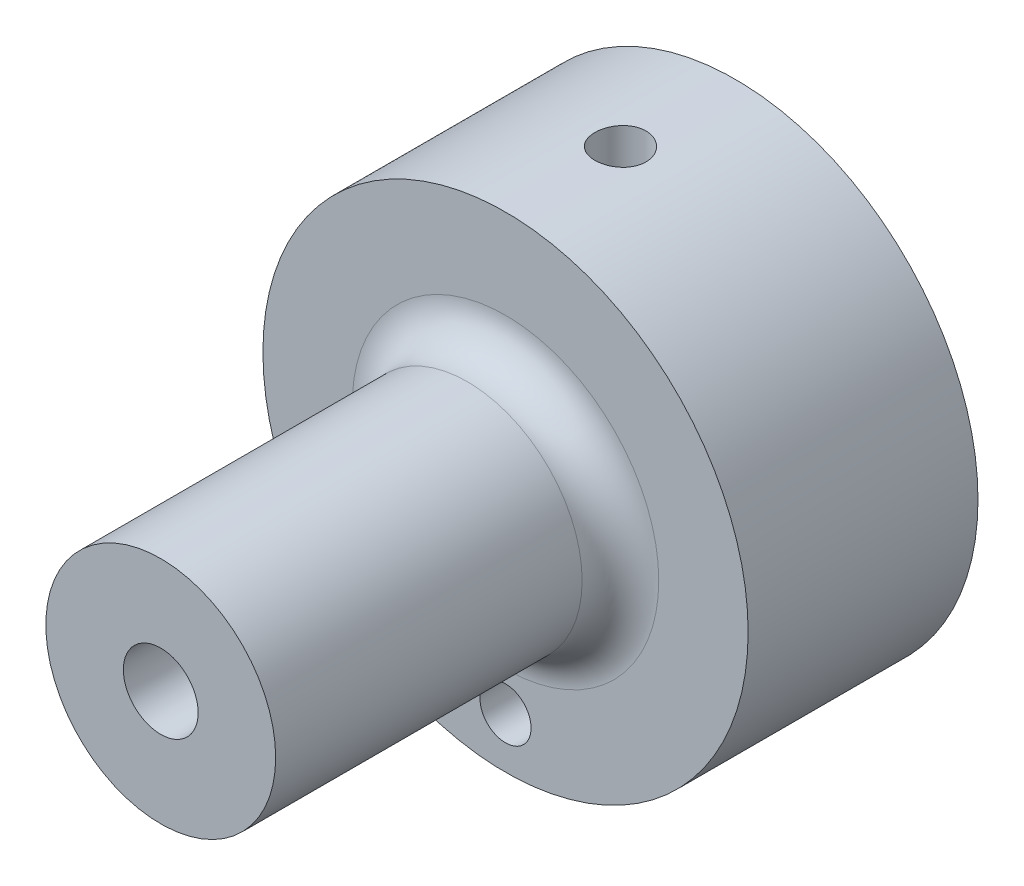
ISO-10303-21;
HEADER;
FILE_DESCRIPTION(('STEP AP214'),'2;1');
FILE_NAME('part.step','',(''),(''),'','','');
FILE_SCHEMA(('AUTOMOTIVE_DESIGN { 1 0 10303 214 1 1 1 1 }'));
ENDSEC;
DATA;
#1=APPLICATION_CONTEXT('core data for automotive mechanical design processes');
#2=APPLICATION_PROTOCOL_DEFINITION('international standard','automotive_design',2000,#1);
#3=PRODUCT_CONTEXT('',#1,'mechanical');
#4=PRODUCT('Part','Part','',(#3));
#5=PRODUCT_RELATED_PRODUCT_CATEGORY('part','',(#4));
#6=PRODUCT_DEFINITION_FORMATION('','',#4);
#7=PRODUCT_DEFINITION_CONTEXT('part definition',#1,'design');
#8=PRODUCT_DEFINITION('design','',#6,#7);
#9=PRODUCT_DEFINITION_SHAPE('','',#8);
#10=(LENGTH_UNIT() NAMED_UNIT(*) SI_UNIT(.MILLI.,.METRE.));
#11=(NAMED_UNIT(*) PLANE_ANGLE_UNIT() SI_UNIT($,.RADIAN.));
#12=(NAMED_UNIT(*) SI_UNIT($,.STERADIAN.) SOLID_ANGLE_UNIT());
#13=UNCERTAINTY_MEASURE_WITH_UNIT(LENGTH_MEASURE(1.E-05),#10,'distance_accuracy_value','');
#14=(GEOMETRIC_REPRESENTATION_CONTEXT(3) GLOBAL_UNCERTAINTY_ASSIGNED_CONTEXT((#13)) GLOBAL_UNIT_ASSIGNED_CONTEXT((#10,
#11,#12)) REPRESENTATION_CONTEXT('',''));
#15=CARTESIAN_POINT('',(0.,0.,0.));
#16=DIRECTION('',(0.,0.,1.));
#17=DIRECTION('',(1.,0.,0.));
#18=AXIS2_PLACEMENT_3D('',#15,#16,#17);
#19=CARTESIAN_POINT('',(0.,0.,27.));
#20=DIRECTION('',(0.,0.,1.));
#21=DIRECTION('',(1.,0.,0.));
#22=AXIS2_PLACEMENT_3D('',#19,#20,#21);
#23=CONICAL_SURFACE('',#22,2.92836647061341,0.026179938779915);
#24=CARTESIAN_POINT('',(0.,0.,27.));
#25=DIRECTION('',(0.,0.,1.));
#26=DIRECTION('',(1.,0.,0.));
#27=AXIS2_PLACEMENT_3D('',#24,#25,#26);
#28=CIRCLE('',#27,2.92836647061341);
#29=CARTESIAN_POINT('',(2.92836647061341,0.,27.));
#30=VERTEX_POINT('',#29);
#31=EDGE_CURVE('E105',#30,#30,#28,.T.);
#32=ORIENTED_EDGE('',*,*,#31,.T.);
#33=EDGE_LOOP('',(#32));
#34=FACE_BOUND('',#33,.T.);
#35=CARTESIAN_POINT('',(0.,0.,-16.6033070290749));
#36=DIRECTION('',(0.,0.,-1.));
#37=DIRECTION('',(-1.,0.,0.));
#38=AXIS2_PLACEMENT_3D('',#35,#36,#37);
#39=CIRCLE('',#38,1.78657369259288);
#40=CARTESIAN_POINT('',(0.,1.78657369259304,-16.6033070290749));
#41=VERTEX_POINT('',#40);
#42=EDGE_CURVE('E38',#41,#41,#39,.F.);
#43=ORIENTED_EDGE('',*,*,#42,.F.);
#44=EDGE_LOOP('',(#43));
#45=FACE_BOUND('',#44,.T.);
#46=ADVANCED_FACE('F34',(#34,#45),#23,.F.);
#47=CARTESIAN_POINT('',(0.,0.,27.));
#48=DIRECTION('',(0.,0.,1.));
#49=DIRECTION('',(1.,0.,0.));
#50=AXIS2_PLACEMENT_3D('',#47,#48,#49);
#51=CYLINDRICAL_SURFACE('',#50,19.);
#52=CARTESIAN_POINT('',(0.,0.,0.));
#53=DIRECTION('',(0.,0.,1.));
#54=DIRECTION('',(1.,0.,0.));
#55=AXIS2_PLACEMENT_3D('',#52,#53,#54);
#56=CIRCLE('',#55,19.);
#57=CARTESIAN_POINT('',(19.,0.,0.));
#58=VERTEX_POINT('',#57);
#59=EDGE_CURVE('E99',#58,#58,#56,.T.);
#60=ORIENTED_EDGE('',*,*,#59,.F.);
#61=EDGE_LOOP('',(#60));
#62=FACE_BOUND('',#61,.T.);
#63=CARTESIAN_POINT('',(0.,0.,-18.));
#64=DIRECTION('',(0.,0.,1.));
#65=DIRECTION('',(1.,0.,0.));
#66=AXIS2_PLACEMENT_3D('',#63,#64,#65);
#67=CIRCLE('',#66,19.);
#68=CARTESIAN_POINT('',(19.,0.,-18.));
#69=VERTEX_POINT('',#68);
#70=EDGE_CURVE('E102',#69,#69,#67,.T.);
#71=ORIENTED_EDGE('',*,*,#70,.T.);
#72=EDGE_LOOP('',(#71));
#73=FACE_BOUND('',#72,.T.);
#74=CARTESIAN_POINT('',(0.,19.,-7.));
#75=CARTESIAN_POINT('',(0.11200841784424,18.9999986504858,-7.00000483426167));
#76=CARTESIAN_POINT('',(0.224090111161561,18.9989990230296,-7.00944110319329));
#77=CARTESIAN_POINT('',(0.445143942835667,18.9951074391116,-7.04694052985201));
#78=CARTESIAN_POINT('',(0.554112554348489,18.9922134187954,-7.07502400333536));
#79=CARTESIAN_POINT('',(0.765707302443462,18.9848596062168,-7.14898929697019));
#80=CARTESIAN_POINT('',(0.868337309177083,18.9804007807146,-7.19486012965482));
#81=CARTESIAN_POINT('',(1.06441973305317,18.9704154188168,-7.30307616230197));
#82=CARTESIAN_POINT('',(1.15787392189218,18.9648890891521,-7.36541817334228));
#83=CARTESIAN_POINT('',(1.33334438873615,18.9533628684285,-7.50507204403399));
#84=CARTESIAN_POINT('',(1.41531912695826,18.9473613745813,-7.58243596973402));
#85=CARTESIAN_POINT('',(1.565146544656,18.9355744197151,-7.74982634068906));
#86=CARTESIAN_POINT('',(1.63299855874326,18.9297889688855,-7.83985338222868));
#87=CARTESIAN_POINT('',(1.75280323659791,18.9190729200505,-8.03027660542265));
#88=CARTESIAN_POINT('',(1.80471802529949,18.914144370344,-8.13069674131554));
#89=CARTESIAN_POINT('',(1.89093273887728,18.9057203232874,-8.33888977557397));
#90=CARTESIAN_POINT('',(1.92523314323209,18.90222478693,-8.44666247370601));
#91=CARTESIAN_POINT('',(1.97512160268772,18.8970772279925,-8.66607599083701));
#92=CARTESIAN_POINT('',(1.99077883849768,18.89541839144,-8.77770091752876));
#93=CARTESIAN_POINT('',(2.0031504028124,18.8941109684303,-9.00200560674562));
#94=CARTESIAN_POINT('',(1.99986527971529,18.8944623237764,-9.11468533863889));
#95=CARTESIAN_POINT('',(1.97450235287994,18.8971293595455,-9.337423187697));
#96=CARTESIAN_POINT('',(1.9525002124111,18.8994371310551,-9.44749002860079));
#97=CARTESIAN_POINT('',(1.8904456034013,18.9057446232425,-9.66236016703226));
#98=CARTESIAN_POINT('',(1.85039286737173,18.9097443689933,-9.76716338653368));
#99=CARTESIAN_POINT('',(1.75329092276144,18.9189942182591,-9.9687695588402));
#100=CARTESIAN_POINT('',(1.69620827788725,18.924246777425,-10.0655562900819));
#101=CARTESIAN_POINT('',(1.5666908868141,18.9354083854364,-10.2482045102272));
#102=CARTESIAN_POINT('',(1.49425564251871,18.9413174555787,-10.3340656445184));
#103=CARTESIAN_POINT('',(1.33566725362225,18.9531615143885,-10.4928649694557));
#104=CARTESIAN_POINT('',(1.24944878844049,18.9590964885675,-10.5657379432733));
#105=CARTESIAN_POINT('',(1.06596783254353,18.9702964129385,-10.6959864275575));
#106=CARTESIAN_POINT('',(0.968705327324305,18.9755613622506,-10.753361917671));
#107=CARTESIAN_POINT('',(0.765851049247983,18.9848300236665,-10.8509846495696));
#108=CARTESIAN_POINT('',(0.660257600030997,18.9888334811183,-10.891228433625));
#109=CARTESIAN_POINT('',(0.443760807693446,18.9951255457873,-10.9533968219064));
#110=CARTESIAN_POINT('',(0.332857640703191,18.9974142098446,-10.9753220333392));
#111=CARTESIAN_POINT('',(0.10945415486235,19.0000115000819,-11.0001478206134));
#112=CARTESIAN_POINT('',(-0.00303606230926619,19.0003294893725,-11.0031383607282));
#113=CARTESIAN_POINT('',(-0.226916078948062,18.9989747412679,-10.9902464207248));
#114=CARTESIAN_POINT('',(-0.338305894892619,18.9973020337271,-10.9743642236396));
#115=CARTESIAN_POINT('',(-0.55656238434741,18.9921598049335,-10.9242523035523));
#116=CARTESIAN_POINT('',(-0.663438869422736,18.9886944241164,-10.8900648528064));
#117=CARTESIAN_POINT('',(-0.869940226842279,18.9803554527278,-10.8043564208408));
#118=CARTESIAN_POINT('',(-0.96956492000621,18.9754818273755,-10.7528350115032));
#119=CARTESIAN_POINT('',(-1.1591405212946,18.9648478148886,-10.6336991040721));
#120=CARTESIAN_POINT('',(-1.2490542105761,18.9590842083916,-10.5660256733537));
#121=CARTESIAN_POINT('',(-1.4162783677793,18.9473268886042,-10.4165910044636));
#122=CARTESIAN_POINT('',(-1.49358848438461,18.9413331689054,-10.334829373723));
#123=CARTESIAN_POINT('',(-1.63372463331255,18.9297628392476,-10.1591459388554));
#124=CARTESIAN_POINT('',(-1.69649150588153,18.9241879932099,-10.0651768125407));
#125=CARTESIAN_POINT('',(-1.80535237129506,18.9141138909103,-9.86797849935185));
#126=CARTESIAN_POINT('',(-1.85144661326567,18.9096146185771,-9.76474945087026));
#127=CARTESIAN_POINT('',(-1.92555535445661,18.9022123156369,-9.55216215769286));
#128=CARTESIAN_POINT('',(-1.95360469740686,18.8993062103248,-9.44281617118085));
#129=CARTESIAN_POINT('',(-1.99094032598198,18.8954098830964,-9.22093420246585));
#130=CARTESIAN_POINT('',(-2.0002272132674,18.8944195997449,-9.10839832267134));
#131=CARTESIAN_POINT('',(-1.99976544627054,18.8944684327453,-8.88391913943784));
#132=CARTESIAN_POINT('',(-1.99010972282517,18.8954976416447,-8.77197563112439));
#133=CARTESIAN_POINT('',(-1.95223204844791,18.8994483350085,-8.5513107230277));
#134=CARTESIAN_POINT('',(-1.92401007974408,18.9023698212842,-8.44258932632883));
#135=CARTESIAN_POINT('',(-1.84982735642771,18.9097730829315,-8.23145780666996));
#136=CARTESIAN_POINT('',(-1.80386967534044,18.914254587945,-8.12904659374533));
#137=CARTESIAN_POINT('',(-1.69552954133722,18.92427346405,-7.9333762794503));
#138=CARTESIAN_POINT('',(-1.63314712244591,18.9298108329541,-7.84011715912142));
#139=CARTESIAN_POINT('',(-1.49337993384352,18.9413500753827,-7.66492215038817));
#140=CARTESIAN_POINT('',(-1.41592586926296,18.9473540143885,-7.58304167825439));
#141=CARTESIAN_POINT('',(-1.24835332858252,18.9591311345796,-7.43340065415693));
#142=CARTESIAN_POINT('',(-1.15823183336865,18.9649042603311,-7.36564347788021));
#143=CARTESIAN_POINT('',(-0.967607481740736,18.975586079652,-7.24602251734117));
#144=CARTESIAN_POINT('',(-0.867076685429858,18.9804923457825,-7.19420307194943));
#145=CARTESIAN_POINT('',(-0.65875157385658,18.9888617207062,-7.1082506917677));
#146=CARTESIAN_POINT('',(-0.550965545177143,18.9923264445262,-7.07409795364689));
#147=CARTESIAN_POINT('',(-0.368815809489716,18.9965585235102,-7.03289948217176));
#148=CARTESIAN_POINT('',(-0.295613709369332,18.9978430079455,-7.02057919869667));
#149=CARTESIAN_POINT('',(-0.148285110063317,18.9995641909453,-7.00412787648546));
#150=CARTESIAN_POINT('',(-0.0741586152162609,19.0000008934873,-6.9999967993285));
#151=CARTESIAN_POINT('',(0.,19.,-7.));
#152=B_SPLINE_CURVE_WITH_KNOTS('',3,(#74,#75,#76,#77,#78,#79,#80,#81,#82,#83,#84,#85,#86,#87,
#88,#89,#90,#91,#92,#93,#94,#95,#96,#97,#98,#99,#100,#101,#102,#103,#104,#105,#106,#107,#108,
#109,#110,#111,#112,#113,#114,#115,#116,#117,#118,#119,#120,#121,#122,#123,#124,#125,#126,#127,
#128,#129,#130,#131,#132,#133,#134,#135,#136,#137,#138,#139,#140,#141,#142,#143,#144,#145,#146,
#147,#148,#149,#150,#151),.UNSPECIFIED.,.T.,.F.,(4,2,2,2,2,2,2,2,2,2,2,2,2,2,2,2,2,2,2,2,2,2,2,
2,2,2,2,2,2,2,2,2,2,2,2,2,2,2,4),(0.,0.335754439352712,0.671875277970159,1.00778882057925,
1.34363737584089,1.68067146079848,2.01772142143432,2.35556629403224,2.69340196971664,
3.02998006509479,3.36654841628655,3.7017626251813,4.03698180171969,4.3728635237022,
4.70875614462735,5.04629056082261,5.38382542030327,5.72142837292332,6.05902013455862,
6.39500668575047,6.73098819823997,7.06619715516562,7.4014143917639,7.73787392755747,
8.07434284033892,8.41215732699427,8.74996676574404,9.08712193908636,9.42426630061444,
9.75976079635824,10.095255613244,10.4306923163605,10.7661283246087,11.103144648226,
11.4402414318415,11.7782677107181,12.1159142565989,12.3382118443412,12.5605083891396),.UNSPECIFIED.);
#153=CARTESIAN_POINT('',(0.,19.,-7.));
#154=VERTEX_POINT('',#153);
#155=EDGE_CURVE('E11',#154,#154,#152,.T.);
#156=ORIENTED_EDGE('',*,*,#155,.F.);
#157=EDGE_LOOP('',(#156));
#158=FACE_BOUND('',#157,.T.);
#159=ADVANCED_FACE('F66',(#62,#73,#158),#51,.T.);
#160=CARTESIAN_POINT('',(0.,9.,27.));
#161=DIRECTION('',(0.,0.,-1.));
#162=DIRECTION('',(-1.,0.,0.));
#163=AXIS2_PLACEMENT_3D('',#160,#161,#162);
#164=PLANE('',#163);
#165=ORIENTED_EDGE('',*,*,#31,.F.);
#166=EDGE_LOOP('',(#165));
#167=FACE_BOUND('',#166,.T.);
#168=CARTESIAN_POINT('',(0.,0.,27.));
#169=DIRECTION('',(0.,0.,1.));
#170=DIRECTION('',(1.,0.,0.));
#171=AXIS2_PLACEMENT_3D('',#168,#169,#170);
#172=CIRCLE('',#171,9.);
#173=CARTESIAN_POINT('',(9.,0.,27.));
#174=VERTEX_POINT('',#173);
#175=EDGE_CURVE('E43',#174,#174,#172,.T.);
#176=ORIENTED_EDGE('',*,*,#175,.T.);
#177=EDGE_LOOP('',(#176));
#178=FACE_BOUND('',#177,.T.);
#179=ADVANCED_FACE('F36',(#167,#178),#164,.F.);
#180=CARTESIAN_POINT('',(0.,0.,27.));
#181=DIRECTION('',(0.,0.,1.));
#182=DIRECTION('',(1.,0.,0.));
#183=AXIS2_PLACEMENT_3D('',#180,#181,#182);
#184=CYLINDRICAL_SURFACE('',#183,9.);
#185=ORIENTED_EDGE('',*,*,#175,.F.);
#186=EDGE_LOOP('',(#185));
#187=FACE_BOUND('',#186,.T.);
#188=CARTESIAN_POINT('',(0.,0.,3.));
#189=DIRECTION('',(0.,0.,1.));
#190=DIRECTION('',(1.,0.,0.));
#191=AXIS2_PLACEMENT_3D('',#188,#189,#190);
#192=CIRCLE('',#191,9.);
#193=CARTESIAN_POINT('',(9.,0.,3.));
#194=VERTEX_POINT('',#193);
#195=EDGE_CURVE('E93',#194,#194,#192,.T.);
#196=ORIENTED_EDGE('',*,*,#195,.T.);
#197=EDGE_LOOP('',(#196));
#198=FACE_BOUND('',#197,.T.);
#199=ADVANCED_FACE('F176',(#187,#198),#184,.T.);
#200=CARTESIAN_POINT('',(0.,0.,3.));
#201=DIRECTION('',(0.,0.,1.));
#202=DIRECTION('',(1.,0.,0.));
#203=AXIS2_PLACEMENT_3D('',#200,#201,#202);
#204=TOROIDAL_SURFACE('',#203,12.,3.);
#205=ORIENTED_EDGE('',*,*,#195,.F.);
#206=EDGE_LOOP('',(#205));
#207=FACE_BOUND('',#206,.T.);
#208=CARTESIAN_POINT('',(0.,0.,0.));
#209=DIRECTION('',(0.,0.,1.));
#210=DIRECTION('',(1.,0.,0.));
#211=AXIS2_PLACEMENT_3D('',#208,#209,#210);
#212=CIRCLE('',#211,12.);
#213=CARTESIAN_POINT('',(12.,0.,0.));
#214=VERTEX_POINT('',#213);
#215=EDGE_CURVE('E96',#214,#214,#212,.T.);
#216=ORIENTED_EDGE('',*,*,#215,.T.);
#217=EDGE_LOOP('',(#216));
#218=FACE_BOUND('',#217,.T.);
#219=ADVANCED_FACE('F171',(#207,#218),#204,.F.);
#220=CARTESIAN_POINT('',(0.,19.,0.));
#221=DIRECTION('',(0.,0.,-1.));
#222=DIRECTION('',(-1.,0.,0.));
#223=AXIS2_PLACEMENT_3D('',#220,#221,#222);
#224=PLANE('',#223);
#225=CARTESIAN_POINT('',(0.,-15.,0.));
#226=DIRECTION('',(0.,0.,1.));
#227=DIRECTION('',(0.,-1.,0.));
#228=AXIS2_PLACEMENT_3D('',#225,#226,#227);
#229=CIRCLE('',#228,2.);
#230=CARTESIAN_POINT('',(0.,-17.,0.));
#231=VERTEX_POINT('',#230);
#232=EDGE_CURVE('E110',#231,#231,#229,.T.);
#233=ORIENTED_EDGE('',*,*,#232,.F.);
#234=EDGE_LOOP('',(#233));
#235=FACE_BOUND('',#234,.T.);
#236=ORIENTED_EDGE('',*,*,#215,.F.);
#237=EDGE_LOOP('',(#236));
#238=FACE_BOUND('',#237,.T.);
#239=ORIENTED_EDGE('',*,*,#59,.T.);
#240=EDGE_LOOP('',(#239));
#241=FACE_BOUND('',#240,.T.);
#242=ADVANCED_FACE('F83',(#235,#238,#241),#224,.F.);
#243=CARTESIAN_POINT('',(0.,1.75,-18.));
#244=DIRECTION('',(0.,0.,1.));
#245=DIRECTION('',(1.,0.,0.));
#246=AXIS2_PLACEMENT_3D('',#243,#244,#245);
#247=PLANE('',#246);
#248=CARTESIAN_POINT('',(0.,0.,-18.));
#249=DIRECTION('',(0.,0.,1.));
#250=DIRECTION('',(0.,-1.,0.));
#251=AXIS2_PLACEMENT_3D('',#248,#249,#250);
#252=CIRCLE('',#251,6.65206734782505);
#253=CARTESIAN_POINT('',(0.,6.65206734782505,-18.));
#254=VERTEX_POINT('',#253);
#255=EDGE_CURVE('E115',#254,#254,#252,.T.);
#256=ORIENTED_EDGE('',*,*,#255,.T.);
#257=EDGE_LOOP('',(#256));
#258=FACE_BOUND('',#257,.T.);
#259=ORIENTED_EDGE('',*,*,#70,.F.);
#260=EDGE_LOOP('',(#259));
#261=FACE_BOUND('',#260,.T.);
#262=ADVANCED_FACE('F81',(#258,#261),#247,.F.);
#263=CARTESIAN_POINT('',(0.,19.,-9.));
#264=DIRECTION('',(0.,1.,0.));
#265=DIRECTION('',(0.,0.,1.));
#266=AXIS2_PLACEMENT_3D('',#263,#264,#265);
#267=CYLINDRICAL_SURFACE('',#266,2.);
#268=CARTESIAN_POINT('',(0.,13.,-9.));
#269=DIRECTION('',(0.,1.,0.));
#270=DIRECTION('',(0.,0.,1.));
#271=AXIS2_PLACEMENT_3D('',#268,#269,#270);
#272=CIRCLE('',#271,2.);
#273=CARTESIAN_POINT('',(0.,13.,-7.));
#274=VERTEX_POINT('',#273);
#275=EDGE_CURVE('E107',#274,#274,#272,.T.);
#276=ORIENTED_EDGE('',*,*,#275,.F.);
#277=EDGE_LOOP('',(#276));
#278=FACE_BOUND('',#277,.T.);
#279=ORIENTED_EDGE('',*,*,#155,.T.);
#280=EDGE_LOOP('',(#279));
#281=FACE_BOUND('',#280,.T.);
#282=ADVANCED_FACE('F78',(#278,#281),#267,.F.);
#283=CARTESIAN_POINT('',(0.,11.7982787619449,-9.));
#284=DIRECTION('',(0.,1.,0.));
#285=DIRECTION('',(0.,0.,1.));
#286=AXIS2_PLACEMENT_3D('',#283,#284,#285);
#287=CONICAL_SURFACE('',#286,0.,1.02974425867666);
#288=ORIENTED_EDGE('',*,*,#275,.T.);
#289=EDGE_LOOP('',(#288));
#290=FACE_BOUND('',#289,.T.);
#291=CARTESIAN_POINT('',(0.,11.7982787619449,-9.));
#292=VERTEX_POINT('',#291);
#293=VERTEX_LOOP('',#292);
#294=FACE_BOUND('',#293,.T.);
#295=ADVANCED_FACE('F61',(#290,#294),#287,.F.);
#296=CARTESIAN_POINT('',(0.,-15.,0.));
#297=DIRECTION('',(0.,0.,1.));
#298=DIRECTION('',(0.,-1.,0.));
#299=AXIS2_PLACEMENT_3D('',#296,#297,#298);
#300=CYLINDRICAL_SURFACE('',#299,2.);
#301=ORIENTED_EDGE('',*,*,#232,.T.);
#302=EDGE_LOOP('',(#301));
#303=FACE_BOUND('',#302,.T.);
#304=CARTESIAN_POINT('',(0.,-15.,-6.00000000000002));
#305=DIRECTION('',(0.,0.,1.));
#306=DIRECTION('',(0.,-1.,0.));
#307=AXIS2_PLACEMENT_3D('',#304,#305,#306);
#308=CIRCLE('',#307,2.);
#309=CARTESIAN_POINT('',(0.,-17.,-6.00000000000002));
#310=VERTEX_POINT('',#309);
#311=EDGE_CURVE('E113',#310,#310,#308,.T.);
#312=ORIENTED_EDGE('',*,*,#311,.F.);
#313=EDGE_LOOP('',(#312));
#314=FACE_BOUND('',#313,.T.);
#315=ADVANCED_FACE('F52',(#303,#314),#300,.F.);
#316=CARTESIAN_POINT('',(0.,-15.,-7.20172123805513));
#317=DIRECTION('',(0.,0.,1.));
#318=DIRECTION('',(0.,-1.,0.));
#319=AXIS2_PLACEMENT_3D('',#316,#317,#318);
#320=CONICAL_SURFACE('',#319,0.,1.02974425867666);
#321=ORIENTED_EDGE('',*,*,#311,.T.);
#322=EDGE_LOOP('',(#321));
#323=FACE_BOUND('',#322,.T.);
#324=CARTESIAN_POINT('',(0.,-15.,-7.20172123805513));
#325=VERTEX_POINT('',#324);
#326=VERTEX_LOOP('',#325);
#327=FACE_BOUND('',#326,.T.);
#328=ADVANCED_FACE('F49',(#323,#327),#320,.F.);
#329=CARTESIAN_POINT('',(0.,0.,-32.));
#330=DIRECTION('',(0.,0.,1.));
#331=DIRECTION('',(0.,1.,0.));
#332=AXIS2_PLACEMENT_3D('',#329,#330,#331);
#333=SPHERICAL_SURFACE('',#332,15.5);
#334=CARTESIAN_POINT('',(0.,6.65206734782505,-18.));
#335=CARTESIAN_POINT('',(0.,6.60422683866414,-17.9772686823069));
#336=CARTESIAN_POINT('',(0.,6.55626980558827,-17.9547826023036));
#337=CARTESIAN_POINT('',(0.,6.46012775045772,-17.9103032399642));
#338=CARTESIAN_POINT('',(0.,6.41194272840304,-17.8883099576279));
#339=CARTESIAN_POINT('',(0.,6.31534975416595,-17.8448185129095));
#340=CARTESIAN_POINT('',(0.,6.26694180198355,-17.8233203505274));
#341=CARTESIAN_POINT('',(0.,6.16990805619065,-17.7808214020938));
#342=CARTESIAN_POINT('',(0.,6.12128226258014,-17.7598206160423));
#343=CARTESIAN_POINT('',(0.,6.02381794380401,-17.7183186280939));
#344=CARTESIAN_POINT('',(0.,5.97497941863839,-17.6978174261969));
#345=CARTESIAN_POINT('',(0.,5.87709476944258,-17.6573167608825));
#346=CARTESIAN_POINT('',(0.,5.82804864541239,-17.637317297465));
#347=CARTESIAN_POINT('',(0.,5.72975395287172,-17.5978222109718));
#348=CARTESIAN_POINT('',(0.,5.68050538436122,-17.5783265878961));
#349=CARTESIAN_POINT('',(0.,5.58181097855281,-17.5398412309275));
#350=CARTESIAN_POINT('',(0.,5.53236514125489,-17.5208514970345));
#351=CARTESIAN_POINT('',(0.,5.43328139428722,-17.4833799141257));
#352=CARTESIAN_POINT('',(0.,5.38364348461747,-17.4648980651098));
#353=CARTESIAN_POINT('',(0.,5.2841808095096,-17.4284441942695));
#354=CARTESIAN_POINT('',(0.,5.23435604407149,-17.410472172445));
#355=CARTESIAN_POINT('',(0.,5.13452489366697,-17.3750398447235));
#356=CARTESIAN_POINT('',(0.,5.08451850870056,-17.3575795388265));
#357=CARTESIAN_POINT('',(0.,4.98432937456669,-17.3231724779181));
#358=CARTESIAN_POINT('',(0.,4.93414662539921,-17.3062257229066));
#359=CARTESIAN_POINT('',(0.,4.83361003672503,-17.2728475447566));
#360=CARTESIAN_POINT('',(0.,4.78325619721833,-17.2564161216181));
#361=CARTESIAN_POINT('',(0.,4.68238271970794,-17.2240703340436));
#362=CARTESIAN_POINT('',(0.,4.63186308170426,-17.2081559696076));
#363=CARTESIAN_POINT('',(0.,4.53066331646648,-17.1768459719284));
#364=CARTESIAN_POINT('',(0.,4.47998318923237,-17.1614503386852));
#365=CARTESIAN_POINT('',(0.,4.3784677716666,-17.1311794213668));
#366=CARTESIAN_POINT('',(0.,4.32763248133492,-17.1163041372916));
#367=CARTESIAN_POINT('',(0.,4.22581208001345,-17.0870754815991));
#368=CARTESIAN_POINT('',(0.,4.17482696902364,-17.0727221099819));
#369=CARTESIAN_POINT('',(0.,4.07271228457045,-17.0445387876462));
#370=CARTESIAN_POINT('',(0.,4.02158271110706,-17.0307088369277));
#371=CARTESIAN_POINT('',(0.,3.91918447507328,-17.0035738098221));
#372=CARTESIAN_POINT('',(0.,3.86791581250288,-16.990268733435));
#373=CARTESIAN_POINT('',(0.,3.76524478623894,-16.9641848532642));
#374=CARTESIAN_POINT('',(0.,3.7138424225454,-16.9514060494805));
#375=CARTESIAN_POINT('',(0.,3.61090939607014,-16.926376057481));
#376=CARTESIAN_POINT('',(0.,3.55937873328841,-16.9141248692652));
#377=CARTESIAN_POINT('',(0.,3.45619452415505,-16.890151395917));
#378=CARTESIAN_POINT('',(0.,3.40454097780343,-16.8784291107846));
#379=CARTESIAN_POINT('',(0.,3.30111642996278,-16.8555146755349));
#380=CARTESIAN_POINT('',(0.,3.24934542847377,-16.8443225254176));
#381=CARTESIAN_POINT('',(0.,3.14569141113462,-16.8224695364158));
#382=CARTESIAN_POINT('',(0.,3.09380839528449,-16.8118086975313));
#383=CARTESIAN_POINT('',(0.,2.98993580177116,-16.7910194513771));
#384=CARTESIAN_POINT('',(0.,2.93794622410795,-16.7808910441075));
#385=CARTESIAN_POINT('',(0.,2.83386597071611,-16.7611677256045));
#386=CARTESIAN_POINT('',(0.,2.78177529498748,-16.7515728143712));
#387=CARTESIAN_POINT('',(0.,2.6774983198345,-16.7329174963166));
#388=CARTESIAN_POINT('',(0.,2.62531202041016,-16.7238570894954));
#389=CARTESIAN_POINT('',(0.,2.52084928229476,-16.7062717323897));
#390=CARTESIAN_POINT('',(0.,2.46857284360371,-16.6977467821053));
#391=CARTESIAN_POINT('',(0.,2.36393532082,-16.6812332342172));
#392=CARTESIAN_POINT('',(0.,2.31157423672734,-16.6732446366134));
#393=CARTESIAN_POINT('',(0.,2.2067729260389,-16.6578046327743));
#394=CARTESIAN_POINT('',(0.,2.15433269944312,-16.650353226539));
#395=CARTESIAN_POINT('',(0.,2.04937861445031,-16.6359883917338));
#396=CARTESIAN_POINT('',(0.,1.99686475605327,-16.629074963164));
#397=CARTESIAN_POINT('',(0.,1.89176892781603,-16.6157867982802));
#398=CARTESIAN_POINT('',(0.,1.83918695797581,-16.6094120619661));
#399=CARTESIAN_POINT('',(0.,1.78657369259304,-16.6033070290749));
#400=B_SPLINE_CURVE_WITH_KNOTS('',3,(#334,#335,#336,#337,#338,#339,#340,#341,#342,#343,#344,
#345,#346,#347,#348,#349,#350,#351,#352,#353,#354,#355,#356,#357,#358,#359,#360,#361,#362,#363,
#364,#365,#366,#367,#368,#369,#370,#371,#372,#373,#374,#375,#376,#377,#378,#379,#380,#381,#382,
#383,#384,#385,#386,#387,#388,#389,#390,#391,#392,#393,#394,#395,#396,#397,#398,#399),
.UNSPECIFIED.,.F.,.F.,(4,2,2,2,2,2,2,2,2,2,2,2,2,2,2,2,2,2,2,2,2,2,2,2,2,2,2,2,2,2,2,2,4),(0.,
0.158898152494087,0.317796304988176,0.476694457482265,0.635592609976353,0.794490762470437,
0.953388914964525,1.11228706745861,1.2711852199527,1.43008337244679,1.58898152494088,
1.74787967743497,1.90677782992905,2.06567598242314,2.22457413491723,2.38347228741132,
2.5423704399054,2.70126859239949,2.86016674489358,3.01906489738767,3.17796304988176,
3.33686120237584,3.49575935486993,3.65465750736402,3.8135556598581,3.97245381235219,
4.13135196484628,4.29025011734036,4.44914826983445,4.60804642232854,4.76694457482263,
4.92584272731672,5.08474087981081),.UNSPECIFIED.);
#401=EDGE_CURVE('BSEAM51',#254,#41,#400,.T.);
#402=ORIENTED_EDGE('',*,*,#255,.F.);
#403=ORIENTED_EDGE('',*,*,#42,.T.);
#404=ORIENTED_EDGE('',*,*,#401,.T.);
#405=ORIENTED_EDGE('',*,*,#401,.F.);
#406=EDGE_LOOP('',(#402,#404,#403,#405));
#407=FACE_BOUND('',#406,.T.);
#408=ADVANCED_FACE('F51',(#407),#333,.F.);
#409=CLOSED_SHELL('',(#46,#159,#179,#199,#219,#242,#262,#282,#295,#315,#328,#408));
#410=MANIFOLD_SOLID_BREP('B2',#409);
#411=ADVANCED_BREP_SHAPE_REPRESENTATION('',(#18,#410),#14);
#412=SHAPE_DEFINITION_REPRESENTATION(#9,#411);
ENDSEC;
END-ISO-10303-21;
